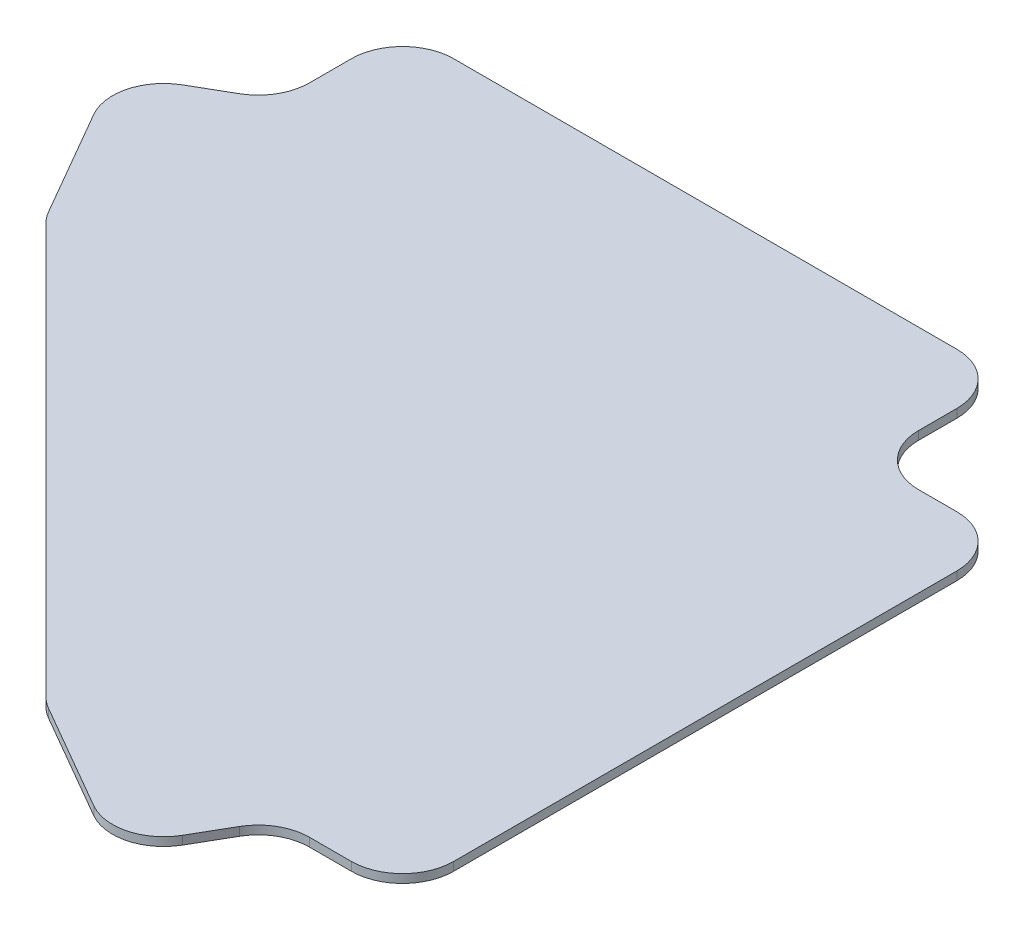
ISO-10303-21;
HEADER;
FILE_DESCRIPTION(('STEP AP214'),'2;1');
FILE_NAME('part.step','',(''),(''),'','','');
FILE_SCHEMA(('AUTOMOTIVE_DESIGN { 1 0 10303 214 1 1 1 1 }'));
ENDSEC;
DATA;
#1=APPLICATION_CONTEXT('core data for automotive mechanical design processes');
#2=APPLICATION_PROTOCOL_DEFINITION('international standard','automotive_design',2000,#1);
#3=PRODUCT_CONTEXT('',#1,'mechanical');
#4=PRODUCT('Part','Part','',(#3));
#5=PRODUCT_RELATED_PRODUCT_CATEGORY('part','',(#4));
#6=PRODUCT_DEFINITION_FORMATION('','',#4);
#7=PRODUCT_DEFINITION_CONTEXT('part definition',#1,'design');
#8=PRODUCT_DEFINITION('design','',#6,#7);
#9=PRODUCT_DEFINITION_SHAPE('','',#8);
#10=(LENGTH_UNIT() NAMED_UNIT(*) SI_UNIT(.MILLI.,.METRE.));
#11=(NAMED_UNIT(*) PLANE_ANGLE_UNIT() SI_UNIT($,.RADIAN.));
#12=(NAMED_UNIT(*) SI_UNIT($,.STERADIAN.) SOLID_ANGLE_UNIT());
#13=UNCERTAINTY_MEASURE_WITH_UNIT(LENGTH_MEASURE(1.E-05),#10,'distance_accuracy_value','');
#14=(GEOMETRIC_REPRESENTATION_CONTEXT(3) GLOBAL_UNCERTAINTY_ASSIGNED_CONTEXT((#13)) GLOBAL_UNIT_ASSIGNED_CONTEXT((#10,
#11,#12)) REPRESENTATION_CONTEXT('',''));
#15=CARTESIAN_POINT('',(0.,0.,0.));
#16=DIRECTION('',(0.,0.,1.));
#17=DIRECTION('',(1.,0.,0.));
#18=AXIS2_PLACEMENT_3D('',#15,#16,#17);
#19=CARTESIAN_POINT('',(-52.3875,3.175,52.3875));
#20=DIRECTION('',(0.,0.,1.));
#21=DIRECTION('',(1.,0.,0.));
#22=AXIS2_PLACEMENT_3D('',#19,#20,#21);
#23=PLANE('',#22);
#24=DIRECTION('',(-1.,0.,0.));
#25=VECTOR('',#24,1.);
#26=CARTESIAN_POINT('',(-52.3875,0.,52.3875));
#27=LINE('',#26,#25);
#28=CARTESIAN_POINT('',(-19.05,0.,52.3875));
#29=VERTEX_POINT('',#28);
#30=CARTESIAN_POINT('',(-33.3375,0.,52.3875));
#31=VERTEX_POINT('',#30);
#32=EDGE_CURVE('E269',#29,#31,#27,.T.);
#33=ORIENTED_EDGE('',*,*,#32,.T.);
#34=DIRECTION('',(0.,-1.,0.));
#35=VECTOR('',#34,1.);
#36=CARTESIAN_POINT('',(-33.3375,3.175,52.3875));
#37=LINE('',#36,#35);
#38=CARTESIAN_POINT('',(-33.3375,3.175,52.3875));
#39=VERTEX_POINT('',#38);
#40=EDGE_CURVE('E243',#31,#39,#37,.F.);
#41=ORIENTED_EDGE('',*,*,#40,.T.);
#42=DIRECTION('',(-1.,0.,0.));
#43=VECTOR('',#42,1.);
#44=CARTESIAN_POINT('',(-52.3875,3.175,52.3875));
#45=LINE('',#44,#43);
#46=CARTESIAN_POINT('',(-19.05,3.175,52.3875));
#47=VERTEX_POINT('',#46);
#48=EDGE_CURVE('E311',#47,#39,#45,.T.);
#49=ORIENTED_EDGE('',*,*,#48,.F.);
#50=DIRECTION('',(0.,-1.,0.));
#51=VECTOR('',#50,1.);
#52=CARTESIAN_POINT('',(-19.05,3.175,52.3875));
#53=LINE('',#52,#51);
#54=EDGE_CURVE('E261',#47,#29,#53,.T.);
#55=ORIENTED_EDGE('',*,*,#54,.T.);
#56=EDGE_LOOP('',(#33,#41,#49,#55));
#57=FACE_BOUND('',#56,.T.);
#58=ADVANCED_FACE('F43',(#57),#23,.F.);
#59=CARTESIAN_POINT('',(-52.3875,3.175,0.));
#60=DIRECTION('',(-1.,0.,0.));
#61=DIRECTION('',(0.,0.,1.));
#62=AXIS2_PLACEMENT_3D('',#59,#60,#61);
#63=PLANE('',#62);
#64=DIRECTION('',(0.,0.,-1.));
#65=VECTOR('',#64,1.);
#66=CARTESIAN_POINT('',(-52.3875,3.175,0.));
#67=LINE('',#66,#65);
#68=CARTESIAN_POINT('',(-52.3875,3.175,33.3375));
#69=VERTEX_POINT('',#68);
#70=CARTESIAN_POINT('',(-52.3875,3.175,19.05));
#71=VERTEX_POINT('',#70);
#72=EDGE_CURVE('E259',#69,#71,#67,.T.);
#73=ORIENTED_EDGE('',*,*,#72,.F.);
#74=DIRECTION('',(0.,-1.,0.));
#75=VECTOR('',#74,1.);
#76=CARTESIAN_POINT('',(-52.3875,0.,33.3375));
#77=LINE('',#76,#75);
#78=CARTESIAN_POINT('',(-52.3875,0.,33.3375));
#79=VERTEX_POINT('',#78);
#80=EDGE_CURVE('E242',#69,#79,#77,.T.);
#81=ORIENTED_EDGE('',*,*,#80,.T.);
#82=DIRECTION('',(0.,0.,-1.));
#83=VECTOR('',#82,1.);
#84=CARTESIAN_POINT('',(-52.3875,0.,0.));
#85=LINE('',#84,#83);
#86=CARTESIAN_POINT('',(-52.3875,0.,19.05));
#87=VERTEX_POINT('',#86);
#88=EDGE_CURVE('E256',#79,#87,#85,.T.);
#89=ORIENTED_EDGE('',*,*,#88,.T.);
#90=DIRECTION('',(0.,-1.,0.));
#91=VECTOR('',#90,1.);
#92=CARTESIAN_POINT('',(-52.3875,3.175,19.05));
#93=LINE('',#92,#91);
#94=EDGE_CURVE('E262',#87,#71,#93,.F.);
#95=ORIENTED_EDGE('',*,*,#94,.T.);
#96=EDGE_LOOP('',(#73,#81,#89,#95));
#97=FACE_BOUND('',#96,.T.);
#98=ADVANCED_FACE('F255',(#97),#63,.F.);
#99=CARTESIAN_POINT('',(-52.3875,3.175,0.));
#100=DIRECTION('',(0.,0.,1.));
#101=DIRECTION('',(1.,0.,0.));
#102=AXIS2_PLACEMENT_3D('',#99,#100,#101);
#103=PLANE('',#102);
#104=DIRECTION('',(-1.,0.,0.));
#105=VECTOR('',#104,1.);
#106=CARTESIAN_POINT('',(-52.3875,3.175,0.));
#107=LINE('',#106,#105);
#108=CARTESIAN_POINT('',(-71.4375,3.175,0.));
#109=VERTEX_POINT('',#108);
#110=CARTESIAN_POINT('',(-258.7625,3.175,0.));
#111=VERTEX_POINT('',#110);
#112=EDGE_CURVE('E464',#109,#111,#107,.T.);
#113=ORIENTED_EDGE('',*,*,#112,.F.);
#114=DIRECTION('',(0.,-1.,0.));
#115=VECTOR('',#114,1.);
#116=CARTESIAN_POINT('',(-71.4375,3.175,0.));
#117=LINE('',#116,#115);
#118=CARTESIAN_POINT('',(-71.4375,0.,0.));
#119=VERTEX_POINT('',#118);
#120=EDGE_CURVE('E323',#109,#119,#117,.T.);
#121=ORIENTED_EDGE('',*,*,#120,.T.);
#122=DIRECTION('',(-1.,0.,0.));
#123=VECTOR('',#122,1.);
#124=CARTESIAN_POINT('',(-52.3875,0.,0.));
#125=LINE('',#124,#123);
#126=CARTESIAN_POINT('',(-258.7625,0.,0.));
#127=VERTEX_POINT('',#126);
#128=EDGE_CURVE('E268',#119,#127,#125,.T.);
#129=ORIENTED_EDGE('',*,*,#128,.T.);
#130=DIRECTION('',(0.,-1.,0.));
#131=VECTOR('',#130,1.);
#132=CARTESIAN_POINT('',(-258.7625,3.175,0.));
#133=LINE('',#132,#131);
#134=EDGE_CURVE('E320',#127,#111,#133,.F.);
#135=ORIENTED_EDGE('',*,*,#134,.T.);
#136=EDGE_LOOP('',(#113,#121,#129,#135));
#137=FACE_BOUND('',#136,.T.);
#138=ADVANCED_FACE('F547',(#137),#103,.F.);
#139=CARTESIAN_POINT('',(-277.8125,3.175,45.6297630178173));
#140=DIRECTION('',(1.,0.,0.));
#141=DIRECTION('',(0.,0.,-1.));
#142=AXIS2_PLACEMENT_3D('',#139,#140,#141);
#143=PLANE('',#142);
#144=DIRECTION('',(0.,0.,1.));
#145=VECTOR('',#144,1.);
#146=CARTESIAN_POINT('',(-277.8125,3.175,45.6297630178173));
#147=LINE('',#146,#145);
#148=CARTESIAN_POINT('',(-277.8125,3.175,19.05));
#149=VERTEX_POINT('',#148);
#150=CARTESIAN_POINT('',(-277.8125,3.175,34.631240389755));
#151=VERTEX_POINT('',#150);
#152=EDGE_CURVE('E453',#149,#151,#147,.T.);
#153=ORIENTED_EDGE('',*,*,#152,.F.);
#154=DIRECTION('',(0.,-1.,0.));
#155=VECTOR('',#154,1.);
#156=CARTESIAN_POINT('',(-277.8125,3.175,19.05));
#157=LINE('',#156,#155);
#158=CARTESIAN_POINT('',(-277.8125,0.,19.05));
#159=VERTEX_POINT('',#158);
#160=EDGE_CURVE('E417',#149,#159,#157,.T.);
#161=ORIENTED_EDGE('',*,*,#160,.T.);
#162=DIRECTION('',(0.,0.,1.));
#163=VECTOR('',#162,1.);
#164=CARTESIAN_POINT('',(-277.8125,0.,45.6297630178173));
#165=LINE('',#164,#163);
#166=CARTESIAN_POINT('',(-277.8125,0.,34.631240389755));
#167=VERTEX_POINT('',#166);
#168=EDGE_CURVE('E275',#159,#167,#165,.T.);
#169=ORIENTED_EDGE('',*,*,#168,.T.);
#170=DIRECTION('',(0.,-1.,0.));
#171=VECTOR('',#170,1.);
#172=CARTESIAN_POINT('',(-277.8125,3.175,34.631240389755));
#173=LINE('',#172,#171);
#174=EDGE_CURVE('E414',#167,#151,#173,.F.);
#175=ORIENTED_EDGE('',*,*,#174,.T.);
#176=EDGE_LOOP('',(#153,#161,#169,#175));
#177=FACE_BOUND('',#176,.T.);
#178=ADVANCED_FACE('F443',(#177),#143,.F.);
#179=CARTESIAN_POINT('',(-317.329033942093,3.175,68.444644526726));
#180=DIRECTION('',(0.500000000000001,0.,0.866025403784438));
#181=DIRECTION('',(0.866025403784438,0.,-0.500000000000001));
#182=AXIS2_PLACEMENT_3D('',#179,#180,#181);
#183=PLANE('',#182);
#184=DIRECTION('',(-0.866025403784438,0.,0.500000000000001));
#185=VECTOR('',#184,1.);
#186=CARTESIAN_POINT('',(-317.329033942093,3.175,68.444644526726));
#187=LINE('',#186,#185);
#188=CARTESIAN_POINT('',(-287.3375,3.175,51.1290243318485));
#189=VERTEX_POINT('',#188);
#190=CARTESIAN_POINT('',(-300.83125,3.175,58.919644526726));
#191=VERTEX_POINT('',#190);
#192=EDGE_CURVE('E451',#189,#191,#187,.T.);
#193=ORIENTED_EDGE('',*,*,#192,.F.);
#194=DIRECTION('',(0.,-1.,0.));
#195=VECTOR('',#194,1.);
#196=CARTESIAN_POINT('',(-287.3375,0.,51.1290243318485));
#197=LINE('',#196,#195);
#198=CARTESIAN_POINT('',(-287.3375,0.,51.1290243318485));
#199=VERTEX_POINT('',#198);
#200=EDGE_CURVE('E250',#189,#199,#197,.T.);
#201=ORIENTED_EDGE('',*,*,#200,.T.);
#202=DIRECTION('',(-0.866025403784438,0.,0.500000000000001));
#203=VECTOR('',#202,1.);
#204=CARTESIAN_POINT('',(-317.329033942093,0.,68.444644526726));
#205=LINE('',#204,#203);
#206=CARTESIAN_POINT('',(-300.83125,0.,58.919644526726));
#207=VERTEX_POINT('',#206);
#208=EDGE_CURVE('E284',#199,#207,#205,.T.);
#209=ORIENTED_EDGE('',*,*,#208,.T.);
#210=DIRECTION('',(0.,-1.,0.));
#211=VECTOR('',#210,1.);
#212=CARTESIAN_POINT('',(-300.83125,3.175,58.919644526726));
#213=LINE('',#212,#211);
#214=EDGE_CURVE('E421',#207,#191,#213,.F.);
#215=ORIENTED_EDGE('',*,*,#214,.T.);
#216=EDGE_LOOP('',(#193,#201,#209,#215));
#217=FACE_BOUND('',#216,.T.);
#218=ADVANCED_FACE('F455',(#217),#183,.F.);
#219=CARTESIAN_POINT('',(-317.329033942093,3.175,68.444644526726));
#220=DIRECTION('',(0.866025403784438,0.,-0.5));
#221=DIRECTION('',(-0.500000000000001,0.,-0.866025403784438));
#222=AXIS2_PLACEMENT_3D('',#219,#220,#221);
#223=PLANE('',#222);
#224=DIRECTION('',(0.5,0.,0.866025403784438));
#225=VECTOR('',#224,1.);
#226=CARTESIAN_POINT('',(-317.329033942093,0.,68.444644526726));
#227=LINE('',#226,#225);
#228=CARTESIAN_POINT('',(-307.804033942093,0.,84.9424284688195));
#229=VERTEX_POINT('',#228);
#230=CARTESIAN_POINT('',(-284.776073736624,0.,124.828025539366));
#231=VERTEX_POINT('',#230);
#232=EDGE_CURVE('E288',#229,#231,#227,.T.);
#233=ORIENTED_EDGE('',*,*,#232,.T.);
#234=DIRECTION('',(0.,-1.,0.));
#235=VECTOR('',#234,1.);
#236=CARTESIAN_POINT('',(-284.776073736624,3.175,124.828025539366));
#237=LINE('',#236,#235);
#238=CARTESIAN_POINT('',(-284.776073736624,3.175,124.828025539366));
#239=VERTEX_POINT('',#238);
#240=EDGE_CURVE('E411',#231,#239,#237,.F.);
#241=ORIENTED_EDGE('',*,*,#240,.T.);
#242=DIRECTION('',(0.5,0.,0.866025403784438));
#243=VECTOR('',#242,1.);
#244=CARTESIAN_POINT('',(-317.329033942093,3.175,68.444644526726));
#245=LINE('',#244,#243);
#246=CARTESIAN_POINT('',(-307.804033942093,3.175,84.9424284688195));
#247=VERTEX_POINT('',#246);
#248=EDGE_CURVE('E458',#247,#239,#245,.T.);
#249=ORIENTED_EDGE('',*,*,#248,.F.);
#250=DIRECTION('',(0.,-1.,0.));
#251=VECTOR('',#250,1.);
#252=CARTESIAN_POINT('',(-307.804033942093,3.175,84.9424284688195));
#253=LINE('',#252,#251);
#254=EDGE_CURVE('E407',#247,#229,#253,.T.);
#255=ORIENTED_EDGE('',*,*,#254,.T.);
#256=EDGE_LOOP('',(#233,#241,#249,#255));
#257=FACE_BOUND('',#256,.T.);
#258=ADVANCED_FACE('F533',(#257),#223,.F.);
#259=CARTESIAN_POINT('',(-283.522083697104,3.175,127.));
#260=DIRECTION('',(0.707106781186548,0.,-0.707106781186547));
#261=DIRECTION('',(-0.707106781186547,0.,-0.707106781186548));
#262=AXIS2_PLACEMENT_3D('',#259,#260,#261);
#263=PLANE('',#262);
#264=DIRECTION('',(0.707106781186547,0.,0.707106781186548));
#265=VECTOR('',#264,1.);
#266=CARTESIAN_POINT('',(-283.522083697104,0.,127.));
#267=LINE('',#266,#265);
#268=CARTESIAN_POINT('',(-281.748673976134,0.,128.77340972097));
#269=VERTEX_POINT('',#268);
#270=CARTESIAN_POINT('',(-128.77340972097,0.,281.748673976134));
#271=VERTEX_POINT('',#270);
#272=EDGE_CURVE('E292',#269,#271,#267,.T.);
#273=ORIENTED_EDGE('',*,*,#272,.T.);
#274=DIRECTION('',(0.,-1.,0.));
#275=VECTOR('',#274,1.);
#276=CARTESIAN_POINT('',(-128.77340972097,3.175,281.748673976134));
#277=LINE('',#276,#275);
#278=CARTESIAN_POINT('',(-128.77340972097,3.175,281.748673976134));
#279=VERTEX_POINT('',#278);
#280=EDGE_CURVE('E404',#271,#279,#277,.F.);
#281=ORIENTED_EDGE('',*,*,#280,.T.);
#282=DIRECTION('',(0.707106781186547,0.,0.707106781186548));
#283=VECTOR('',#282,1.);
#284=CARTESIAN_POINT('',(-283.522083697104,3.175,127.));
#285=LINE('',#284,#283);
#286=CARTESIAN_POINT('',(-281.748673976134,3.175,128.77340972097));
#287=VERTEX_POINT('',#286);
#288=EDGE_CURVE('E462',#287,#279,#285,.T.);
#289=ORIENTED_EDGE('',*,*,#288,.F.);
#290=DIRECTION('',(0.,-1.,0.));
#291=VECTOR('',#290,1.);
#292=CARTESIAN_POINT('',(-281.748673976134,3.175,128.77340972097));
#293=LINE('',#292,#291);
#294=EDGE_CURVE('E400',#287,#269,#293,.T.);
#295=ORIENTED_EDGE('',*,*,#294,.T.);
#296=EDGE_LOOP('',(#273,#281,#289,#295));
#297=FACE_BOUND('',#296,.T.);
#298=ADVANCED_FACE('F524',(#297),#263,.F.);
#299=CARTESIAN_POINT('',(-127.,3.175,283.522083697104));
#300=DIRECTION('',(0.5,0.,-0.866025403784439));
#301=DIRECTION('',(-0.866025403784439,0.,-0.5));
#302=AXIS2_PLACEMENT_3D('',#299,#300,#301);
#303=PLANE('',#302);
#304=DIRECTION('',(0.866025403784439,0.,0.5));
#305=VECTOR('',#304,1.);
#306=CARTESIAN_POINT('',(-127.,0.,283.522083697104));
#307=LINE('',#306,#305);
#308=CARTESIAN_POINT('',(-124.828025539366,0.,284.776073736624));
#309=VERTEX_POINT('',#308);
#310=CARTESIAN_POINT('',(-84.9424284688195,0.,307.804033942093));
#311=VERTEX_POINT('',#310);
#312=EDGE_CURVE('E296',#309,#311,#307,.T.);
#313=ORIENTED_EDGE('',*,*,#312,.T.);
#314=DIRECTION('',(0.,-1.,0.));
#315=VECTOR('',#314,1.);
#316=CARTESIAN_POINT('',(-84.9424284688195,3.175,307.804033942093));
#317=LINE('',#316,#315);
#318=CARTESIAN_POINT('',(-84.9424284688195,3.175,307.804033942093));
#319=VERTEX_POINT('',#318);
#320=EDGE_CURVE('E397',#311,#319,#317,.F.);
#321=ORIENTED_EDGE('',*,*,#320,.T.);
#322=DIRECTION('',(0.866025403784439,0.,0.5));
#323=VECTOR('',#322,1.);
#324=CARTESIAN_POINT('',(-127.,3.175,283.522083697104));
#325=LINE('',#324,#323);
#326=CARTESIAN_POINT('',(-124.828025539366,3.175,284.776073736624));
#327=VERTEX_POINT('',#326);
#328=EDGE_CURVE('E471',#327,#319,#325,.T.);
#329=ORIENTED_EDGE('',*,*,#328,.F.);
#330=DIRECTION('',(0.,-1.,0.));
#331=VECTOR('',#330,1.);
#332=CARTESIAN_POINT('',(-124.828025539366,3.175,284.776073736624));
#333=LINE('',#332,#331);
#334=EDGE_CURVE('E393',#327,#309,#333,.T.);
#335=ORIENTED_EDGE('',*,*,#334,.T.);
#336=EDGE_LOOP('',(#313,#321,#329,#335));
#337=FACE_BOUND('',#336,.T.);
#338=ADVANCED_FACE('F515',(#337),#303,.F.);
#339=CARTESIAN_POINT('',(-45.6297630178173,3.175,277.8125));
#340=DIRECTION('',(-0.866025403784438,0.,-0.500000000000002));
#341=DIRECTION('',(-0.500000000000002,0.,0.866025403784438));
#342=AXIS2_PLACEMENT_3D('',#339,#340,#341);
#343=PLANE('',#342);
#344=DIRECTION('',(0.500000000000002,0.,-0.866025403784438));
#345=VECTOR('',#344,1.);
#346=CARTESIAN_POINT('',(-45.6297630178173,0.,277.8125));
#347=LINE('',#346,#345);
#348=CARTESIAN_POINT('',(-58.919644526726,0.,300.83125));
#349=VERTEX_POINT('',#348);
#350=CARTESIAN_POINT('',(-51.1290243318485,0.,287.3375));
#351=VERTEX_POINT('',#350);
#352=EDGE_CURVE('E300',#349,#351,#347,.T.);
#353=ORIENTED_EDGE('',*,*,#352,.T.);
#354=DIRECTION('',(0.,-1.,0.));
#355=VECTOR('',#354,1.);
#356=CARTESIAN_POINT('',(-51.1290243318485,3.175,287.3375));
#357=LINE('',#356,#355);
#358=CARTESIAN_POINT('',(-51.1290243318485,3.175,287.3375));
#359=VERTEX_POINT('',#358);
#360=EDGE_CURVE('E390',#351,#359,#357,.F.);
#361=ORIENTED_EDGE('',*,*,#360,.T.);
#362=DIRECTION('',(0.500000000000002,0.,-0.866025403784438));
#363=VECTOR('',#362,1.);
#364=CARTESIAN_POINT('',(-45.6297630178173,3.175,277.8125));
#365=LINE('',#364,#363);
#366=CARTESIAN_POINT('',(-58.919644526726,3.175,300.83125));
#367=VERTEX_POINT('',#366);
#368=EDGE_CURVE('E475',#367,#359,#365,.T.);
#369=ORIENTED_EDGE('',*,*,#368,.F.);
#370=DIRECTION('',(0.,-1.,0.));
#371=VECTOR('',#370,1.);
#372=CARTESIAN_POINT('',(-58.919644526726,3.175,300.83125));
#373=LINE('',#372,#371);
#374=EDGE_CURVE('E386',#367,#349,#373,.T.);
#375=ORIENTED_EDGE('',*,*,#374,.T.);
#376=EDGE_LOOP('',(#353,#361,#369,#375));
#377=FACE_BOUND('',#376,.T.);
#378=ADVANCED_FACE('F506',(#377),#343,.F.);
#379=CARTESIAN_POINT('',(0.,3.175,277.8125));
#380=DIRECTION('',(0.,0.,-1.));
#381=DIRECTION('',(-1.,0.,0.));
#382=AXIS2_PLACEMENT_3D('',#379,#380,#381);
#383=PLANE('',#382);
#384=DIRECTION('',(1.,0.,0.));
#385=VECTOR('',#384,1.);
#386=CARTESIAN_POINT('',(0.,0.,277.8125));
#387=LINE('',#386,#385);
#388=CARTESIAN_POINT('',(-34.631240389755,0.,277.8125));
#389=VERTEX_POINT('',#388);
#390=CARTESIAN_POINT('',(-19.0499999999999,0.,277.8125));
#391=VERTEX_POINT('',#390);
#392=EDGE_CURVE('E304',#389,#391,#387,.T.);
#393=ORIENTED_EDGE('',*,*,#392,.T.);
#394=DIRECTION('',(0.,-1.,0.));
#395=VECTOR('',#394,1.);
#396=CARTESIAN_POINT('',(-19.0499999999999,3.175,277.8125));
#397=LINE('',#396,#395);
#398=CARTESIAN_POINT('',(-19.0499999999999,3.175,277.8125));
#399=VERTEX_POINT('',#398);
#400=EDGE_CURVE('E383',#391,#399,#397,.F.);
#401=ORIENTED_EDGE('',*,*,#400,.T.);
#402=DIRECTION('',(1.,0.,0.));
#403=VECTOR('',#402,1.);
#404=CARTESIAN_POINT('',(0.,3.175,277.8125));
#405=LINE('',#404,#403);
#406=CARTESIAN_POINT('',(-34.631240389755,3.175,277.8125));
#407=VERTEX_POINT('',#406);
#408=EDGE_CURVE('E479',#407,#399,#405,.T.);
#409=ORIENTED_EDGE('',*,*,#408,.F.);
#410=DIRECTION('',(0.,-1.,0.));
#411=VECTOR('',#410,1.);
#412=CARTESIAN_POINT('',(-34.631240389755,0.,277.8125));
#413=LINE('',#412,#411);
#414=EDGE_CURVE('E379',#407,#389,#413,.T.);
#415=ORIENTED_EDGE('',*,*,#414,.T.);
#416=EDGE_LOOP('',(#393,#401,#409,#415));
#417=FACE_BOUND('',#416,.T.);
#418=ADVANCED_FACE('F497',(#417),#383,.F.);
#419=CARTESIAN_POINT('',(0.,3.175,52.3875));
#420=DIRECTION('',(-1.,0.,0.));
#421=DIRECTION('',(0.,0.,1.));
#422=AXIS2_PLACEMENT_3D('',#419,#420,#421);
#423=PLANE('',#422);
#424=DIRECTION('',(0.,0.,-1.));
#425=VECTOR('',#424,1.);
#426=CARTESIAN_POINT('',(0.,0.,52.3875));
#427=LINE('',#426,#425);
#428=CARTESIAN_POINT('',(0.,0.,258.7625));
#429=VERTEX_POINT('',#428);
#430=CARTESIAN_POINT('',(0.,0.,71.4375));
#431=VERTEX_POINT('',#430);
#432=EDGE_CURVE('E308',#429,#431,#427,.T.);
#433=ORIENTED_EDGE('',*,*,#432,.T.);
#434=DIRECTION('',(0.,-1.,0.));
#435=VECTOR('',#434,1.);
#436=CARTESIAN_POINT('',(0.,3.175,71.4375));
#437=LINE('',#436,#435);
#438=CARTESIAN_POINT('',(0.,3.175,71.4375));
#439=VERTEX_POINT('',#438);
#440=EDGE_CURVE('E61',#431,#439,#437,.F.);
#441=ORIENTED_EDGE('',*,*,#440,.T.);
#442=DIRECTION('',(0.,0.,-1.));
#443=VECTOR('',#442,1.);
#444=CARTESIAN_POINT('',(0.,3.175,52.3875));
#445=LINE('',#444,#443);
#446=CARTESIAN_POINT('',(0.,3.175,258.7625));
#447=VERTEX_POINT('',#446);
#448=EDGE_CURVE('E313',#447,#439,#445,.T.);
#449=ORIENTED_EDGE('',*,*,#448,.F.);
#450=DIRECTION('',(0.,-1.,0.));
#451=VECTOR('',#450,1.);
#452=CARTESIAN_POINT('',(0.,3.175,258.7625));
#453=LINE('',#452,#451);
#454=EDGE_CURVE('E373',#447,#429,#453,.T.);
#455=ORIENTED_EDGE('',*,*,#454,.T.);
#456=EDGE_LOOP('',(#433,#441,#449,#455));
#457=FACE_BOUND('',#456,.T.);
#458=ADVANCED_FACE('F491',(#457),#423,.F.);
#459=CARTESIAN_POINT('',(0.,3.175,52.3875));
#460=DIRECTION('',(0.,-1.,0.));
#461=DIRECTION('',(0.,0.,-1.));
#462=AXIS2_PLACEMENT_3D('',#459,#460,#461);
#463=PLANE('',#462);
#464=ORIENTED_EDGE('',*,*,#72,.T.);
#465=CARTESIAN_POINT('',(-71.4375,3.175,19.05));
#466=DIRECTION('',(0.,-1.,0.));
#467=DIRECTION('',(0.,0.,-1.));
#468=AXIS2_PLACEMENT_3D('',#465,#466,#467);
#469=CIRCLE('',#468,19.05);
#470=EDGE_CURVE('E370',#71,#109,#469,.F.);
#471=ORIENTED_EDGE('',*,*,#470,.T.);
#472=ORIENTED_EDGE('',*,*,#112,.T.);
#473=CARTESIAN_POINT('',(-258.7625,3.175,19.05));
#474=DIRECTION('',(0.,-1.,0.));
#475=DIRECTION('',(0.,0.,-1.));
#476=AXIS2_PLACEMENT_3D('',#473,#474,#475);
#477=CIRCLE('',#476,19.05);
#478=EDGE_CURVE('E353',#111,#149,#477,.F.);
#479=ORIENTED_EDGE('',*,*,#478,.T.);
#480=ORIENTED_EDGE('',*,*,#152,.T.);
#481=CARTESIAN_POINT('',(-296.8625,3.175,34.631240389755));
#482=DIRECTION('',(0.,-1.,0.));
#483=DIRECTION('',(0.,0.,-1.));
#484=AXIS2_PLACEMENT_3D('',#481,#482,#483);
#485=CIRCLE('',#484,19.05);
#486=EDGE_CURVE('E11',#151,#189,#485,.T.);
#487=ORIENTED_EDGE('',*,*,#486,.T.);
#488=ORIENTED_EDGE('',*,*,#192,.T.);
#489=CARTESIAN_POINT('',(-291.30625,3.175,75.4174284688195));
#490=DIRECTION('',(0.,-1.,0.));
#491=DIRECTION('',(0.,0.,-1.));
#492=AXIS2_PLACEMENT_3D('',#489,#490,#491);
#493=CIRCLE('',#492,19.05);
#494=EDGE_CURVE('E350',#191,#247,#493,.F.);
#495=ORIENTED_EDGE('',*,*,#494,.T.);
#496=ORIENTED_EDGE('',*,*,#248,.T.);
#497=CARTESIAN_POINT('',(-268.278289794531,3.175,115.303025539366));
#498=DIRECTION('',(0.,-1.,0.));
#499=DIRECTION('',(0.,0.,-1.));
#500=AXIS2_PLACEMENT_3D('',#497,#498,#499);
#501=CIRCLE('',#500,19.05);
#502=EDGE_CURVE('E356',#239,#287,#501,.F.);
#503=ORIENTED_EDGE('',*,*,#502,.T.);
#504=ORIENTED_EDGE('',*,*,#288,.T.);
#505=CARTESIAN_POINT('',(-115.303025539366,3.175,268.278289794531));
#506=DIRECTION('',(0.,-1.,0.));
#507=DIRECTION('',(0.,0.,-1.));
#508=AXIS2_PLACEMENT_3D('',#505,#506,#507);
#509=CIRCLE('',#508,19.05);
#510=EDGE_CURVE('E359',#279,#327,#509,.F.);
#511=ORIENTED_EDGE('',*,*,#510,.T.);
#512=ORIENTED_EDGE('',*,*,#328,.T.);
#513=CARTESIAN_POINT('',(-75.4174284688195,3.175,291.30625));
#514=DIRECTION('',(0.,-1.,0.));
#515=DIRECTION('',(0.,0.,-1.));
#516=AXIS2_PLACEMENT_3D('',#513,#514,#515);
#517=CIRCLE('',#516,19.05);
#518=EDGE_CURVE('E362',#319,#367,#517,.F.);
#519=ORIENTED_EDGE('',*,*,#518,.T.);
#520=ORIENTED_EDGE('',*,*,#368,.T.);
#521=CARTESIAN_POINT('',(-34.631240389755,3.175,296.8625));
#522=DIRECTION('',(0.,-1.,0.));
#523=DIRECTION('',(0.,0.,-1.));
#524=AXIS2_PLACEMENT_3D('',#521,#522,#523);
#525=CIRCLE('',#524,19.05);
#526=EDGE_CURVE('E432',#359,#407,#525,.T.);
#527=ORIENTED_EDGE('',*,*,#526,.T.);
#528=ORIENTED_EDGE('',*,*,#408,.T.);
#529=CARTESIAN_POINT('',(-19.05,3.175,258.7625));
#530=DIRECTION('',(0.,-1.,0.));
#531=DIRECTION('',(0.,0.,-1.));
#532=AXIS2_PLACEMENT_3D('',#529,#530,#531);
#533=CIRCLE('',#532,19.05);
#534=EDGE_CURVE('E71',#399,#447,#533,.F.);
#535=ORIENTED_EDGE('',*,*,#534,.T.);
#536=ORIENTED_EDGE('',*,*,#448,.T.);
#537=CARTESIAN_POINT('',(-19.05,3.175,71.4375));
#538=DIRECTION('',(0.,-1.,0.));
#539=DIRECTION('',(0.,0.,-1.));
#540=AXIS2_PLACEMENT_3D('',#537,#538,#539);
#541=CIRCLE('',#540,19.05);
#542=EDGE_CURVE('E367',#439,#47,#541,.F.);
#543=ORIENTED_EDGE('',*,*,#542,.T.);
#544=ORIENTED_EDGE('',*,*,#48,.T.);
#545=CARTESIAN_POINT('',(-33.3375,3.175,33.3375));
#546=DIRECTION('',(0.,-1.,0.));
#547=DIRECTION('',(0.,0.,-1.));
#548=AXIS2_PLACEMENT_3D('',#545,#546,#547);
#549=CIRCLE('',#548,19.05);
#550=EDGE_CURVE('E249',#39,#69,#549,.T.);
#551=ORIENTED_EDGE('',*,*,#550,.T.);
#552=EDGE_LOOP('',(#464,#471,#472,#479,#480,#487,#488,#495,#496,#503,#504,#511,#512,#519,#520,
#527,#528,#535,#536,#543,#544,#551));
#553=FACE_BOUND('',#552,.T.);
#554=ADVANCED_FACE('F450',(#553),#463,.F.);
#555=CARTESIAN_POINT('',(0.,0.,52.3875));
#556=DIRECTION('',(0.,-1.,0.));
#557=DIRECTION('',(0.,0.,-1.));
#558=AXIS2_PLACEMENT_3D('',#555,#556,#557);
#559=PLANE('',#558);
#560=ORIENTED_EDGE('',*,*,#128,.F.);
#561=CARTESIAN_POINT('',(-71.4375,0.,19.05));
#562=DIRECTION('',(0.,-1.,0.));
#563=DIRECTION('',(0.,0.,-1.));
#564=AXIS2_PLACEMENT_3D('',#561,#562,#563);
#565=CIRCLE('',#564,19.05);
#566=EDGE_CURVE('E266',#119,#87,#565,.T.);
#567=ORIENTED_EDGE('',*,*,#566,.T.);
#568=ORIENTED_EDGE('',*,*,#88,.F.);
#569=CARTESIAN_POINT('',(-33.3375,0.,33.3375));
#570=DIRECTION('',(0.,-1.,0.));
#571=DIRECTION('',(0.,0.,-1.));
#572=AXIS2_PLACEMENT_3D('',#569,#570,#571);
#573=CIRCLE('',#572,19.05);
#574=EDGE_CURVE('E238',#79,#31,#573,.F.);
#575=ORIENTED_EDGE('',*,*,#574,.T.);
#576=ORIENTED_EDGE('',*,*,#32,.F.);
#577=CARTESIAN_POINT('',(-19.05,0.,71.4375));
#578=DIRECTION('',(0.,-1.,0.));
#579=DIRECTION('',(0.,0.,-1.));
#580=AXIS2_PLACEMENT_3D('',#577,#578,#579);
#581=CIRCLE('',#580,19.05);
#582=EDGE_CURVE('E345',#29,#431,#581,.T.);
#583=ORIENTED_EDGE('',*,*,#582,.T.);
#584=ORIENTED_EDGE('',*,*,#432,.F.);
#585=CARTESIAN_POINT('',(-19.05,0.,258.7625));
#586=DIRECTION('',(0.,-1.,0.));
#587=DIRECTION('',(0.,0.,-1.));
#588=AXIS2_PLACEMENT_3D('',#585,#586,#587);
#589=CIRCLE('',#588,19.05);
#590=EDGE_CURVE('E342',#429,#391,#589,.T.);
#591=ORIENTED_EDGE('',*,*,#590,.T.);
#592=ORIENTED_EDGE('',*,*,#392,.F.);
#593=CARTESIAN_POINT('',(-34.631240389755,0.,296.8625));
#594=DIRECTION('',(0.,-1.,0.));
#595=DIRECTION('',(0.,0.,-1.));
#596=AXIS2_PLACEMENT_3D('',#593,#594,#595);
#597=CIRCLE('',#596,19.05);
#598=EDGE_CURVE('E429',#389,#351,#597,.F.);
#599=ORIENTED_EDGE('',*,*,#598,.T.);
#600=ORIENTED_EDGE('',*,*,#352,.F.);
#601=CARTESIAN_POINT('',(-75.4174284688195,0.,291.30625));
#602=DIRECTION('',(0.,-1.,0.));
#603=DIRECTION('',(0.,0.,-1.));
#604=AXIS2_PLACEMENT_3D('',#601,#602,#603);
#605=CIRCLE('',#604,19.05);
#606=EDGE_CURVE('E339',#349,#311,#605,.T.);
#607=ORIENTED_EDGE('',*,*,#606,.T.);
#608=ORIENTED_EDGE('',*,*,#312,.F.);
#609=CARTESIAN_POINT('',(-115.303025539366,0.,268.278289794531));
#610=DIRECTION('',(0.,-1.,0.));
#611=DIRECTION('',(0.,0.,-1.));
#612=AXIS2_PLACEMENT_3D('',#609,#610,#611);
#613=CIRCLE('',#612,19.05);
#614=EDGE_CURVE('E336',#309,#271,#613,.T.);
#615=ORIENTED_EDGE('',*,*,#614,.T.);
#616=ORIENTED_EDGE('',*,*,#272,.F.);
#617=CARTESIAN_POINT('',(-268.278289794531,0.,115.303025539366));
#618=DIRECTION('',(0.,-1.,0.));
#619=DIRECTION('',(0.,0.,-1.));
#620=AXIS2_PLACEMENT_3D('',#617,#618,#619);
#621=CIRCLE('',#620,19.05);
#622=EDGE_CURVE('E333',#269,#231,#621,.T.);
#623=ORIENTED_EDGE('',*,*,#622,.T.);
#624=ORIENTED_EDGE('',*,*,#232,.F.);
#625=CARTESIAN_POINT('',(-291.30625,0.,75.4174284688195));
#626=DIRECTION('',(0.,-1.,0.));
#627=DIRECTION('',(0.,0.,-1.));
#628=AXIS2_PLACEMENT_3D('',#625,#626,#627);
#629=CIRCLE('',#628,19.05);
#630=EDGE_CURVE('E327',#229,#207,#629,.T.);
#631=ORIENTED_EDGE('',*,*,#630,.T.);
#632=ORIENTED_EDGE('',*,*,#208,.F.);
#633=CARTESIAN_POINT('',(-296.8625,0.,34.631240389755));
#634=DIRECTION('',(0.,-1.,0.));
#635=DIRECTION('',(0.,0.,-1.));
#636=AXIS2_PLACEMENT_3D('',#633,#634,#635);
#637=CIRCLE('',#636,19.05);
#638=EDGE_CURVE('E52',#199,#167,#637,.F.);
#639=ORIENTED_EDGE('',*,*,#638,.T.);
#640=ORIENTED_EDGE('',*,*,#168,.F.);
#641=CARTESIAN_POINT('',(-258.7625,0.,19.05));
#642=DIRECTION('',(0.,-1.,0.));
#643=DIRECTION('',(0.,0.,-1.));
#644=AXIS2_PLACEMENT_3D('',#641,#642,#643);
#645=CIRCLE('',#644,19.05);
#646=EDGE_CURVE('E330',#159,#127,#645,.T.);
#647=ORIENTED_EDGE('',*,*,#646,.T.);
#648=EDGE_LOOP('',(#560,#567,#568,#575,#576,#583,#584,#591,#592,#599,#600,#607,#608,#615,#616,
#623,#624,#631,#632,#639,#640,#647));
#649=FACE_BOUND('',#648,.T.);
#650=ADVANCED_FACE('F265',(#649),#559,.T.);
#651=CARTESIAN_POINT('',(-33.3375,3.175,33.3375));
#652=DIRECTION('',(0.,1.,0.));
#653=DIRECTION('',(0.,0.,1.));
#654=AXIS2_PLACEMENT_3D('',#651,#652,#653);
#655=CYLINDRICAL_SURFACE('',#654,19.05);
#656=ORIENTED_EDGE('',*,*,#550,.F.);
#657=ORIENTED_EDGE('',*,*,#40,.F.);
#658=ORIENTED_EDGE('',*,*,#574,.F.);
#659=ORIENTED_EDGE('',*,*,#80,.F.);
#660=EDGE_LOOP('',(#656,#657,#658,#659));
#661=FACE_BOUND('',#660,.T.);
#662=ADVANCED_FACE('F241',(#661),#655,.F.);
#663=CARTESIAN_POINT('',(-71.4375,3.175,19.05));
#664=DIRECTION('',(0.,-1.,0.));
#665=DIRECTION('',(0.,0.,-1.));
#666=AXIS2_PLACEMENT_3D('',#663,#664,#665);
#667=CYLINDRICAL_SURFACE('',#666,19.05);
#668=ORIENTED_EDGE('',*,*,#470,.F.);
#669=ORIENTED_EDGE('',*,*,#94,.F.);
#670=ORIENTED_EDGE('',*,*,#566,.F.);
#671=ORIENTED_EDGE('',*,*,#120,.F.);
#672=EDGE_LOOP('',(#668,#669,#670,#671));
#673=FACE_BOUND('',#672,.T.);
#674=ADVANCED_FACE('F553',(#673),#667,.T.);
#675=CARTESIAN_POINT('',(-19.05,3.175,71.4375));
#676=DIRECTION('',(0.,-1.,0.));
#677=DIRECTION('',(0.,0.,-1.));
#678=AXIS2_PLACEMENT_3D('',#675,#676,#677);
#679=CYLINDRICAL_SURFACE('',#678,19.05);
#680=ORIENTED_EDGE('',*,*,#542,.F.);
#681=ORIENTED_EDGE('',*,*,#440,.F.);
#682=ORIENTED_EDGE('',*,*,#582,.F.);
#683=ORIENTED_EDGE('',*,*,#54,.F.);
#684=EDGE_LOOP('',(#680,#681,#682,#683));
#685=FACE_BOUND('',#684,.T.);
#686=ADVANCED_FACE('F488',(#685),#679,.T.);
#687=CARTESIAN_POINT('',(-19.05,3.175,258.7625));
#688=DIRECTION('',(0.,-1.,0.));
#689=DIRECTION('',(0.,0.,-1.));
#690=AXIS2_PLACEMENT_3D('',#687,#688,#689);
#691=CYLINDRICAL_SURFACE('',#690,19.05);
#692=ORIENTED_EDGE('',*,*,#534,.F.);
#693=ORIENTED_EDGE('',*,*,#400,.F.);
#694=ORIENTED_EDGE('',*,*,#590,.F.);
#695=ORIENTED_EDGE('',*,*,#454,.F.);
#696=EDGE_LOOP('',(#692,#693,#694,#695));
#697=FACE_BOUND('',#696,.T.);
#698=ADVANCED_FACE('F493',(#697),#691,.T.);
#699=CARTESIAN_POINT('',(-34.631240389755,3.175,296.8625));
#700=DIRECTION('',(0.,1.,0.));
#701=DIRECTION('',(0.,0.,1.));
#702=AXIS2_PLACEMENT_3D('',#699,#700,#701);
#703=CYLINDRICAL_SURFACE('',#702,19.05);
#704=ORIENTED_EDGE('',*,*,#526,.F.);
#705=ORIENTED_EDGE('',*,*,#360,.F.);
#706=ORIENTED_EDGE('',*,*,#598,.F.);
#707=ORIENTED_EDGE('',*,*,#414,.F.);
#708=EDGE_LOOP('',(#704,#705,#706,#707));
#709=FACE_BOUND('',#708,.T.);
#710=ADVANCED_FACE('F502',(#709),#703,.F.);
#711=CARTESIAN_POINT('',(-75.4174284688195,3.175,291.30625));
#712=DIRECTION('',(0.,-1.,0.));
#713=DIRECTION('',(0.,0.,-1.));
#714=AXIS2_PLACEMENT_3D('',#711,#712,#713);
#715=CYLINDRICAL_SURFACE('',#714,19.05);
#716=ORIENTED_EDGE('',*,*,#518,.F.);
#717=ORIENTED_EDGE('',*,*,#320,.F.);
#718=ORIENTED_EDGE('',*,*,#606,.F.);
#719=ORIENTED_EDGE('',*,*,#374,.F.);
#720=EDGE_LOOP('',(#716,#717,#718,#719));
#721=FACE_BOUND('',#720,.T.);
#722=ADVANCED_FACE('F511',(#721),#715,.T.);
#723=CARTESIAN_POINT('',(-115.303025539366,3.175,268.278289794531));
#724=DIRECTION('',(0.,-1.,0.));
#725=DIRECTION('',(0.,0.,-1.));
#726=AXIS2_PLACEMENT_3D('',#723,#724,#725);
#727=CYLINDRICAL_SURFACE('',#726,19.05);
#728=ORIENTED_EDGE('',*,*,#510,.F.);
#729=ORIENTED_EDGE('',*,*,#280,.F.);
#730=ORIENTED_EDGE('',*,*,#614,.F.);
#731=ORIENTED_EDGE('',*,*,#334,.F.);
#732=EDGE_LOOP('',(#728,#729,#730,#731));
#733=FACE_BOUND('',#732,.T.);
#734=ADVANCED_FACE('F520',(#733),#727,.T.);
#735=CARTESIAN_POINT('',(-268.278289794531,3.175,115.303025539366));
#736=DIRECTION('',(0.,-1.,0.));
#737=DIRECTION('',(0.,0.,-1.));
#738=AXIS2_PLACEMENT_3D('',#735,#736,#737);
#739=CYLINDRICAL_SURFACE('',#738,19.05);
#740=ORIENTED_EDGE('',*,*,#502,.F.);
#741=ORIENTED_EDGE('',*,*,#240,.F.);
#742=ORIENTED_EDGE('',*,*,#622,.F.);
#743=ORIENTED_EDGE('',*,*,#294,.F.);
#744=EDGE_LOOP('',(#740,#741,#742,#743));
#745=FACE_BOUND('',#744,.T.);
#746=ADVANCED_FACE('F529',(#745),#739,.T.);
#747=CARTESIAN_POINT('',(-258.7625,3.175,19.05));
#748=DIRECTION('',(0.,-1.,0.));
#749=DIRECTION('',(0.,0.,-1.));
#750=AXIS2_PLACEMENT_3D('',#747,#748,#749);
#751=CYLINDRICAL_SURFACE('',#750,19.05);
#752=ORIENTED_EDGE('',*,*,#478,.F.);
#753=ORIENTED_EDGE('',*,*,#134,.F.);
#754=ORIENTED_EDGE('',*,*,#646,.F.);
#755=ORIENTED_EDGE('',*,*,#160,.F.);
#756=EDGE_LOOP('',(#752,#753,#754,#755));
#757=FACE_BOUND('',#756,.T.);
#758=ADVANCED_FACE('F541',(#757),#751,.T.);
#759=CARTESIAN_POINT('',(-296.8625,3.175,34.631240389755));
#760=DIRECTION('',(0.,1.,0.));
#761=DIRECTION('',(0.,0.,1.));
#762=AXIS2_PLACEMENT_3D('',#759,#760,#761);
#763=CYLINDRICAL_SURFACE('',#762,19.05);
#764=ORIENTED_EDGE('',*,*,#486,.F.);
#765=ORIENTED_EDGE('',*,*,#174,.F.);
#766=ORIENTED_EDGE('',*,*,#638,.F.);
#767=ORIENTED_EDGE('',*,*,#200,.F.);
#768=EDGE_LOOP('',(#764,#765,#766,#767));
#769=FACE_BOUND('',#768,.T.);
#770=ADVANCED_FACE('F447',(#769),#763,.F.);
#771=CARTESIAN_POINT('',(-291.30625,3.175,75.4174284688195));
#772=DIRECTION('',(0.,-1.,0.));
#773=DIRECTION('',(0.,0.,-1.));
#774=AXIS2_PLACEMENT_3D('',#771,#772,#773);
#775=CYLINDRICAL_SURFACE('',#774,19.05);
#776=ORIENTED_EDGE('',*,*,#494,.F.);
#777=ORIENTED_EDGE('',*,*,#214,.F.);
#778=ORIENTED_EDGE('',*,*,#630,.F.);
#779=ORIENTED_EDGE('',*,*,#254,.F.);
#780=EDGE_LOOP('',(#776,#777,#778,#779));
#781=FACE_BOUND('',#780,.T.);
#782=ADVANCED_FACE('F45',(#781),#775,.T.);
#783=CLOSED_SHELL('',(#58,#98,#138,#178,#218,#258,#298,#338,#378,#418,#458,#554,#650,#662,#674,
#686,#698,#710,#722,#734,#746,#758,#770,#782));
#784=MANIFOLD_SOLID_BREP('B2',#783);
#785=ADVANCED_BREP_SHAPE_REPRESENTATION('',(#18,#784),#14);
#786=SHAPE_DEFINITION_REPRESENTATION(#9,#785);
ENDSEC;
END-ISO-10303-21;
